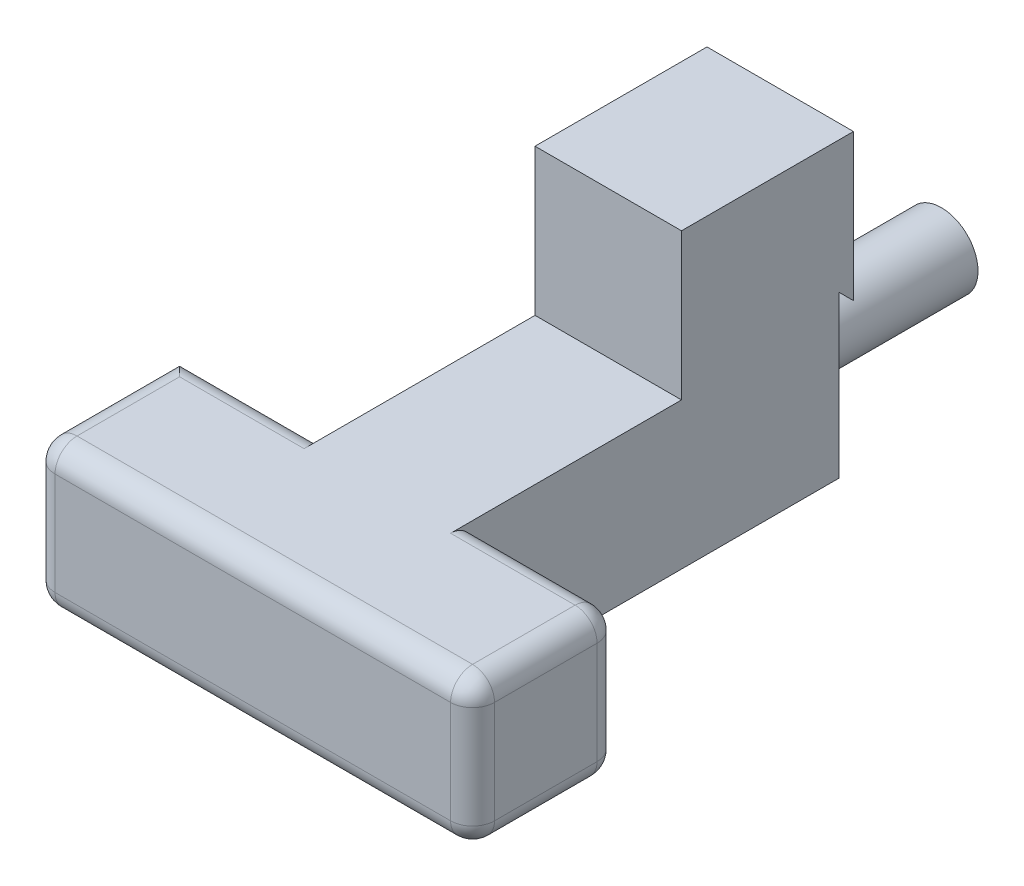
ISO-10303-21;
HEADER;
FILE_DESCRIPTION(('STEP AP214'),'2;1');
FILE_NAME('part.step','',(''),(''),'','','');
FILE_SCHEMA(('AUTOMOTIVE_DESIGN { 1 0 10303 214 1 1 1 1 }'));
ENDSEC;
DATA;
#1=APPLICATION_CONTEXT('core data for automotive mechanical design processes');
#2=APPLICATION_PROTOCOL_DEFINITION('international standard','automotive_design',2000,#1);
#3=PRODUCT_CONTEXT('',#1,'mechanical');
#4=PRODUCT('Part','Part','',(#3));
#5=PRODUCT_RELATED_PRODUCT_CATEGORY('part','',(#4));
#6=PRODUCT_DEFINITION_FORMATION('','',#4);
#7=PRODUCT_DEFINITION_CONTEXT('part definition',#1,'design');
#8=PRODUCT_DEFINITION('design','',#6,#7);
#9=PRODUCT_DEFINITION_SHAPE('','',#8);
#10=(LENGTH_UNIT() NAMED_UNIT(*) SI_UNIT(.MILLI.,.METRE.));
#11=(NAMED_UNIT(*) PLANE_ANGLE_UNIT() SI_UNIT($,.RADIAN.));
#12=(NAMED_UNIT(*) SI_UNIT($,.STERADIAN.) SOLID_ANGLE_UNIT());
#13=UNCERTAINTY_MEASURE_WITH_UNIT(LENGTH_MEASURE(1.E-05),#10,'distance_accuracy_value','');
#14=(GEOMETRIC_REPRESENTATION_CONTEXT(3) GLOBAL_UNCERTAINTY_ASSIGNED_CONTEXT((#13)) GLOBAL_UNIT_ASSIGNED_CONTEXT((#10,
#11,#12)) REPRESENTATION_CONTEXT('',''));
#15=CARTESIAN_POINT('',(0.,0.,0.));
#16=DIRECTION('',(0.,0.,1.));
#17=DIRECTION('',(1.,0.,0.));
#18=AXIS2_PLACEMENT_3D('',#15,#16,#17);
#19=CARTESIAN_POINT('',(10.,10.,25.));
#20=DIRECTION('',(-1.,0.,0.));
#21=DIRECTION('',(0.,0.,1.));
#22=AXIS2_PLACEMENT_3D('',#19,#20,#21);
#23=PLANE('',#22);
#24=DIRECTION('',(0.,0.707106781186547,0.707106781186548));
#25=VECTOR('',#24,1.);
#26=CARTESIAN_POINT('',(10.,12.,-25.));
#27=LINE('',#26,#25);
#28=CARTESIAN_POINT('',(10.,10.,-27.));
#29=VERTEX_POINT('',#28);
#30=CARTESIAN_POINT('',(10.,12.,-25.));
#31=VERTEX_POINT('',#30);
#32=EDGE_CURVE('E198',#29,#31,#27,.T.);
#33=ORIENTED_EDGE('',*,*,#32,.F.);
#34=DIRECTION('',(0.,-1.,0.));
#35=VECTOR('',#34,1.);
#36=CARTESIAN_POINT('',(10.,30.,-27.));
#37=LINE('',#36,#35);
#38=CARTESIAN_POINT('',(10.,30.,-27.));
#39=VERTEX_POINT('',#38);
#40=EDGE_CURVE('E231',#39,#29,#37,.T.);
#41=ORIENTED_EDGE('',*,*,#40,.F.);
#42=DIRECTION('',(0.,0.,-1.));
#43=VECTOR('',#42,1.);
#44=CARTESIAN_POINT('',(10.,30.,-3.52397749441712));
#45=LINE('',#44,#43);
#46=CARTESIAN_POINT('',(10.,30.,-3.52397749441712));
#47=VERTEX_POINT('',#46);
#48=EDGE_CURVE('E212',#47,#39,#45,.T.);
#49=ORIENTED_EDGE('',*,*,#48,.F.);
#50=DIRECTION('',(0.,-1.,0.));
#51=VECTOR('',#50,1.);
#52=CARTESIAN_POINT('',(10.,30.,-3.52397749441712));
#53=LINE('',#52,#51);
#54=CARTESIAN_POINT('',(10.,10.,-3.52397749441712));
#55=VERTEX_POINT('',#54);
#56=EDGE_CURVE('E222',#47,#55,#53,.T.);
#57=ORIENTED_EDGE('',*,*,#56,.T.);
#58=DIRECTION('',(0.,0.,-1.));
#59=VECTOR('',#58,1.);
#60=CARTESIAN_POINT('',(10.,10.,25.));
#61=LINE('',#60,#59);
#62=CARTESIAN_POINT('',(10.,10.,28.));
#63=VERTEX_POINT('',#62);
#64=EDGE_CURVE('E195',#63,#55,#61,.T.);
#65=ORIENTED_EDGE('',*,*,#64,.F.);
#66=CARTESIAN_POINT('',(10.,7.,28.));
#67=DIRECTION('',(-1.,0.,0.));
#68=DIRECTION('',(0.,0.,1.));
#69=AXIS2_PLACEMENT_3D('',#66,#67,#68);
#70=CIRCLE('',#69,3.);
#71=CARTESIAN_POINT('',(10.,7.,25.));
#72=VERTEX_POINT('',#71);
#73=EDGE_CURVE('E313',#63,#72,#70,.T.);
#74=ORIENTED_EDGE('',*,*,#73,.T.);
#75=DIRECTION('',(0.,-1.,0.));
#76=VECTOR('',#75,1.);
#77=CARTESIAN_POINT('',(10.,10.,25.));
#78=LINE('',#77,#76);
#79=CARTESIAN_POINT('',(10.,-7.,25.));
#80=VERTEX_POINT('',#79);
#81=EDGE_CURVE('E247',#72,#80,#78,.T.);
#82=ORIENTED_EDGE('',*,*,#81,.T.);
#83=CARTESIAN_POINT('',(10.,-7.,28.));
#84=DIRECTION('',(-1.,0.,0.));
#85=DIRECTION('',(0.,0.,1.));
#86=AXIS2_PLACEMENT_3D('',#83,#84,#85);
#87=CIRCLE('',#86,3.);
#88=CARTESIAN_POINT('',(10.,-10.,28.));
#89=VERTEX_POINT('',#88);
#90=EDGE_CURVE('E311',#80,#89,#87,.T.);
#91=ORIENTED_EDGE('',*,*,#90,.T.);
#92=DIRECTION('',(0.,0.,-1.));
#93=VECTOR('',#92,1.);
#94=CARTESIAN_POINT('',(10.,-10.,25.));
#95=LINE('',#94,#93);
#96=CARTESIAN_POINT('',(10.,-10.,-25.));
#97=VERTEX_POINT('',#96);
#98=EDGE_CURVE('E242',#89,#97,#95,.T.);
#99=ORIENTED_EDGE('',*,*,#98,.T.);
#100=DIRECTION('',(0.,-1.,0.));
#101=VECTOR('',#100,1.);
#102=CARTESIAN_POINT('',(10.,10.,-25.));
#103=LINE('',#102,#101);
#104=EDGE_CURVE('E53',#31,#97,#103,.T.);
#105=ORIENTED_EDGE('',*,*,#104,.F.);
#106=EDGE_LOOP('',(#33,#41,#49,#57,#65,#74,#82,#91,#99,#105));
#107=FACE_BOUND('',#106,.T.);
#108=ADVANCED_FACE('F39',(#107),#23,.F.);
#109=CARTESIAN_POINT('',(-10.,10.,25.));
#110=DIRECTION('',(1.,0.,0.));
#111=DIRECTION('',(0.,0.,-1.));
#112=AXIS2_PLACEMENT_3D('',#109,#110,#111);
#113=PLANE('',#112);
#114=DIRECTION('',(0.,-1.,0.));
#115=VECTOR('',#114,1.);
#116=CARTESIAN_POINT('',(-10.,30.,-27.));
#117=LINE('',#116,#115);
#118=CARTESIAN_POINT('',(-10.,30.,-27.));
#119=VERTEX_POINT('',#118);
#120=CARTESIAN_POINT('',(-10.,10.,-27.));
#121=VERTEX_POINT('',#120);
#122=EDGE_CURVE('E203',#119,#121,#117,.T.);
#123=ORIENTED_EDGE('',*,*,#122,.T.);
#124=DIRECTION('',(0.,0.707106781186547,0.707106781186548));
#125=VECTOR('',#124,1.);
#126=CARTESIAN_POINT('',(-10.,12.,-25.));
#127=LINE('',#126,#125);
#128=CARTESIAN_POINT('',(-10.,12.,-25.));
#129=VERTEX_POINT('',#128);
#130=EDGE_CURVE('E196',#121,#129,#127,.T.);
#131=ORIENTED_EDGE('',*,*,#130,.T.);
#132=DIRECTION('',(0.,-1.,0.));
#133=VECTOR('',#132,1.);
#134=CARTESIAN_POINT('',(-10.,10.,-25.));
#135=LINE('',#134,#133);
#136=CARTESIAN_POINT('',(-10.,-10.,-25.));
#137=VERTEX_POINT('',#136);
#138=EDGE_CURVE('E183',#129,#137,#135,.T.);
#139=ORIENTED_EDGE('',*,*,#138,.T.);
#140=DIRECTION('',(0.,0.,1.));
#141=VECTOR('',#140,1.);
#142=CARTESIAN_POINT('',(-10.,-10.,25.));
#143=LINE('',#142,#141);
#144=CARTESIAN_POINT('',(-10.,-10.,28.));
#145=VERTEX_POINT('',#144);
#146=EDGE_CURVE('E237',#137,#145,#143,.T.);
#147=ORIENTED_EDGE('',*,*,#146,.T.);
#148=CARTESIAN_POINT('',(-10.,-7.,28.));
#149=DIRECTION('',(1.,0.,0.));
#150=DIRECTION('',(0.,0.,-1.));
#151=AXIS2_PLACEMENT_3D('',#148,#149,#150);
#152=CIRCLE('',#151,3.);
#153=CARTESIAN_POINT('',(-10.,-7.,25.));
#154=VERTEX_POINT('',#153);
#155=EDGE_CURVE('E65',#145,#154,#152,.T.);
#156=ORIENTED_EDGE('',*,*,#155,.T.);
#157=DIRECTION('',(0.,-1.,0.));
#158=VECTOR('',#157,1.);
#159=CARTESIAN_POINT('',(-10.,10.,25.));
#160=LINE('',#159,#158);
#161=CARTESIAN_POINT('',(-10.,7.,25.));
#162=VERTEX_POINT('',#161);
#163=EDGE_CURVE('E252',#162,#154,#160,.T.);
#164=ORIENTED_EDGE('',*,*,#163,.F.);
#165=CARTESIAN_POINT('',(-10.,7.,28.));
#166=DIRECTION('',(1.,0.,0.));
#167=DIRECTION('',(0.,0.,-1.));
#168=AXIS2_PLACEMENT_3D('',#165,#166,#167);
#169=CIRCLE('',#168,3.);
#170=CARTESIAN_POINT('',(-10.,10.,28.));
#171=VERTEX_POINT('',#170);
#172=EDGE_CURVE('E50',#162,#171,#169,.T.);
#173=ORIENTED_EDGE('',*,*,#172,.T.);
#174=DIRECTION('',(0.,0.,1.));
#175=VECTOR('',#174,1.);
#176=CARTESIAN_POINT('',(-10.,10.,25.));
#177=LINE('',#176,#175);
#178=CARTESIAN_POINT('',(-10.,10.,-3.52397749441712));
#179=VERTEX_POINT('',#178);
#180=EDGE_CURVE('E239',#179,#171,#177,.T.);
#181=ORIENTED_EDGE('',*,*,#180,.F.);
#182=DIRECTION('',(0.,-1.,0.));
#183=VECTOR('',#182,1.);
#184=CARTESIAN_POINT('',(-10.,30.,-3.52397749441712));
#185=LINE('',#184,#183);
#186=CARTESIAN_POINT('',(-10.,30.,-3.52397749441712));
#187=VERTEX_POINT('',#186);
#188=EDGE_CURVE('E230',#187,#179,#185,.T.);
#189=ORIENTED_EDGE('',*,*,#188,.F.);
#190=DIRECTION('',(0.,0.,1.));
#191=VECTOR('',#190,1.);
#192=CARTESIAN_POINT('',(-10.,30.,-3.52397749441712));
#193=LINE('',#192,#191);
#194=EDGE_CURVE('E220',#119,#187,#193,.T.);
#195=ORIENTED_EDGE('',*,*,#194,.F.);
#196=EDGE_LOOP('',(#123,#131,#139,#147,#156,#164,#173,#181,#189,#195));
#197=FACE_BOUND('',#196,.T.);
#198=ADVANCED_FACE('F204',(#197),#113,.F.);
#199=CARTESIAN_POINT('',(10.,10.,-25.));
#200=DIRECTION('',(0.,0.,1.));
#201=DIRECTION('',(1.,0.,0.));
#202=AXIS2_PLACEMENT_3D('',#199,#200,#201);
#203=PLANE('',#202);
#204=CARTESIAN_POINT('',(0.,0.,-25.));
#205=DIRECTION('',(0.,0.,1.));
#206=DIRECTION('',(1.,0.,0.));
#207=AXIS2_PLACEMENT_3D('',#204,#205,#206);
#208=CIRCLE('',#207,5.);
#209=CARTESIAN_POINT('',(5.,0.,-25.));
#210=VERTEX_POINT('',#209);
#211=EDGE_CURVE('E11',#210,#210,#208,.F.);
#212=ORIENTED_EDGE('',*,*,#211,.F.);
#213=EDGE_LOOP('',(#212));
#214=FACE_BOUND('',#213,.T.);
#215=DIRECTION('',(-1.,0.,0.));
#216=VECTOR('',#215,1.);
#217=CARTESIAN_POINT('',(10.,-10.,-25.));
#218=LINE('',#217,#216);
#219=EDGE_CURVE('E186',#97,#137,#218,.T.);
#220=ORIENTED_EDGE('',*,*,#219,.T.);
#221=ORIENTED_EDGE('',*,*,#138,.F.);
#222=DIRECTION('',(1.,0.,0.));
#223=VECTOR('',#222,1.);
#224=CARTESIAN_POINT('',(-10.,12.,-25.));
#225=LINE('',#224,#223);
#226=EDGE_CURVE('E190',#129,#31,#225,.T.);
#227=ORIENTED_EDGE('',*,*,#226,.T.);
#228=ORIENTED_EDGE('',*,*,#104,.T.);
#229=EDGE_LOOP('',(#220,#221,#227,#228));
#230=FACE_BOUND('',#229,.T.);
#231=ADVANCED_FACE('F187',(#214,#230),#203,.F.);
#232=CARTESIAN_POINT('',(0.,10.,0.));
#233=DIRECTION('',(0.,1.,0.));
#234=DIRECTION('',(0.,0.,1.));
#235=AXIS2_PLACEMENT_3D('',#232,#233,#234);
#236=PLANE('',#235);
#237=DIRECTION('',(-1.,0.,0.));
#238=VECTOR('',#237,1.);
#239=CARTESIAN_POINT('',(10.,10.,28.));
#240=LINE('',#239,#238);
#241=CARTESIAN_POINT('',(27.,10.,28.));
#242=VERTEX_POINT('',#241);
#243=EDGE_CURVE('E265',#242,#63,#240,.T.);
#244=ORIENTED_EDGE('',*,*,#243,.T.);
#245=ORIENTED_EDGE('',*,*,#64,.T.);
#246=DIRECTION('',(1.,0.,0.));
#247=VECTOR('',#246,1.);
#248=CARTESIAN_POINT('',(-10.,10.,-3.52397749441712));
#249=LINE('',#248,#247);
#250=EDGE_CURVE('E213',#179,#55,#249,.T.);
#251=ORIENTED_EDGE('',*,*,#250,.F.);
#252=ORIENTED_EDGE('',*,*,#180,.T.);
#253=DIRECTION('',(-1.,0.,0.));
#254=VECTOR('',#253,1.);
#255=CARTESIAN_POINT('',(-30.,10.,28.));
#256=LINE('',#255,#254);
#257=CARTESIAN_POINT('',(-27.,10.,28.));
#258=VERTEX_POINT('',#257);
#259=EDGE_CURVE('E254',#171,#258,#256,.T.);
#260=ORIENTED_EDGE('',*,*,#259,.T.);
#261=DIRECTION('',(0.,0.,1.));
#262=VECTOR('',#261,1.);
#263=CARTESIAN_POINT('',(-27.,10.,45.));
#264=LINE('',#263,#262);
#265=CARTESIAN_POINT('',(-27.,10.,42.));
#266=VERTEX_POINT('',#265);
#267=EDGE_CURVE('E253',#258,#266,#264,.T.);
#268=ORIENTED_EDGE('',*,*,#267,.T.);
#269=DIRECTION('',(1.,0.,0.));
#270=VECTOR('',#269,1.);
#271=CARTESIAN_POINT('',(30.,10.,42.));
#272=LINE('',#271,#270);
#273=CARTESIAN_POINT('',(27.,10.,42.));
#274=VERTEX_POINT('',#273);
#275=EDGE_CURVE('E259',#266,#274,#272,.T.);
#276=ORIENTED_EDGE('',*,*,#275,.T.);
#277=DIRECTION('',(0.,0.,-1.));
#278=VECTOR('',#277,1.);
#279=CARTESIAN_POINT('',(27.,10.,25.));
#280=LINE('',#279,#278);
#281=EDGE_CURVE('E258',#274,#242,#280,.T.);
#282=ORIENTED_EDGE('',*,*,#281,.T.);
#283=EDGE_LOOP('',(#244,#245,#251,#252,#260,#268,#276,#282));
#284=FACE_BOUND('',#283,.T.);
#285=ADVANCED_FACE('F534',(#284),#236,.T.);
#286=CARTESIAN_POINT('',(0.,-10.,0.));
#287=DIRECTION('',(0.,1.,0.));
#288=DIRECTION('',(0.,0.,1.));
#289=AXIS2_PLACEMENT_3D('',#286,#287,#288);
#290=PLANE('',#289);
#291=DIRECTION('',(-1.,0.,0.));
#292=VECTOR('',#291,1.);
#293=CARTESIAN_POINT('',(0.,-10.,28.));
#294=LINE('',#293,#292);
#295=CARTESIAN_POINT('',(-27.,-10.,28.));
#296=VERTEX_POINT('',#295);
#297=EDGE_CURVE('E303',#296,#145,#294,.F.);
#298=ORIENTED_EDGE('',*,*,#297,.T.);
#299=ORIENTED_EDGE('',*,*,#146,.F.);
#300=ORIENTED_EDGE('',*,*,#219,.F.);
#301=ORIENTED_EDGE('',*,*,#98,.F.);
#302=DIRECTION('',(-1.,0.,0.));
#303=VECTOR('',#302,1.);
#304=CARTESIAN_POINT('',(0.,-10.,28.));
#305=LINE('',#304,#303);
#306=CARTESIAN_POINT('',(27.,-10.,28.));
#307=VERTEX_POINT('',#306);
#308=EDGE_CURVE('E300',#89,#307,#305,.F.);
#309=ORIENTED_EDGE('',*,*,#308,.T.);
#310=DIRECTION('',(0.,0.,-1.));
#311=VECTOR('',#310,1.);
#312=CARTESIAN_POINT('',(27.,-10.,0.));
#313=LINE('',#312,#311);
#314=CARTESIAN_POINT('',(27.,-10.,42.));
#315=VERTEX_POINT('',#314);
#316=EDGE_CURVE('E294',#307,#315,#313,.F.);
#317=ORIENTED_EDGE('',*,*,#316,.T.);
#318=DIRECTION('',(1.,0.,0.));
#319=VECTOR('',#318,1.);
#320=CARTESIAN_POINT('',(0.,-10.,42.));
#321=LINE('',#320,#319);
#322=CARTESIAN_POINT('',(-27.,-10.,42.));
#323=VERTEX_POINT('',#322);
#324=EDGE_CURVE('E299',#315,#323,#321,.F.);
#325=ORIENTED_EDGE('',*,*,#324,.T.);
#326=DIRECTION('',(0.,0.,1.));
#327=VECTOR('',#326,1.);
#328=CARTESIAN_POINT('',(-27.,-10.,0.));
#329=LINE('',#328,#327);
#330=EDGE_CURVE('E301',#323,#296,#329,.F.);
#331=ORIENTED_EDGE('',*,*,#330,.T.);
#332=EDGE_LOOP('',(#298,#299,#300,#301,#309,#317,#325,#331));
#333=FACE_BOUND('',#332,.T.);
#334=ADVANCED_FACE('F399',(#333),#290,.F.);
#335=CARTESIAN_POINT('',(30.,10.,25.));
#336=DIRECTION('',(0.,0.,1.));
#337=DIRECTION('',(1.,0.,0.));
#338=AXIS2_PLACEMENT_3D('',#335,#336,#337);
#339=PLANE('',#338);
#340=ORIENTED_EDGE('',*,*,#163,.T.);
#341=DIRECTION('',(-1.,0.,0.));
#342=VECTOR('',#341,1.);
#343=CARTESIAN_POINT('',(30.,-7.,25.));
#344=LINE('',#343,#342);
#345=CARTESIAN_POINT('',(-30.,-7.,25.));
#346=VERTEX_POINT('',#345);
#347=EDGE_CURVE('E308',#154,#346,#344,.T.);
#348=ORIENTED_EDGE('',*,*,#347,.T.);
#349=DIRECTION('',(0.,-1.,0.));
#350=VECTOR('',#349,1.);
#351=CARTESIAN_POINT('',(-30.,10.,25.));
#352=LINE('',#351,#350);
#353=CARTESIAN_POINT('',(-30.,7.,25.));
#354=VERTEX_POINT('',#353);
#355=EDGE_CURVE('E236',#354,#346,#352,.T.);
#356=ORIENTED_EDGE('',*,*,#355,.F.);
#357=DIRECTION('',(-1.,0.,0.));
#358=VECTOR('',#357,1.);
#359=CARTESIAN_POINT('',(-10.,7.,25.));
#360=LINE('',#359,#358);
#361=EDGE_CURVE('E306',#354,#162,#360,.F.);
#362=ORIENTED_EDGE('',*,*,#361,.T.);
#363=EDGE_LOOP('',(#340,#348,#356,#362));
#364=FACE_BOUND('',#363,.T.);
#365=ADVANCED_FACE('F456',(#364),#339,.F.);
#366=CARTESIAN_POINT('',(-30.,10.,45.));
#367=DIRECTION('',(1.,0.,0.));
#368=DIRECTION('',(0.,0.,-1.));
#369=AXIS2_PLACEMENT_3D('',#366,#367,#368);
#370=PLANE('',#369);
#371=DIRECTION('',(0.,-1.,0.));
#372=VECTOR('',#371,1.);
#373=CARTESIAN_POINT('',(-30.,10.,42.));
#374=LINE('',#373,#372);
#375=CARTESIAN_POINT('',(-30.,-7.,42.));
#376=VERTEX_POINT('',#375);
#377=CARTESIAN_POINT('',(-30.,7.,42.));
#378=VERTEX_POINT('',#377);
#379=EDGE_CURVE('E264',#376,#378,#374,.F.);
#380=ORIENTED_EDGE('',*,*,#379,.T.);
#381=DIRECTION('',(0.,0.,1.));
#382=VECTOR('',#381,1.);
#383=CARTESIAN_POINT('',(-30.,7.,25.));
#384=LINE('',#383,#382);
#385=EDGE_CURVE('E266',#378,#354,#384,.F.);
#386=ORIENTED_EDGE('',*,*,#385,.T.);
#387=ORIENTED_EDGE('',*,*,#355,.T.);
#388=DIRECTION('',(0.,0.,1.));
#389=VECTOR('',#388,1.);
#390=CARTESIAN_POINT('',(-30.,-7.,45.));
#391=LINE('',#390,#389);
#392=EDGE_CURVE('E269',#346,#376,#391,.T.);
#393=ORIENTED_EDGE('',*,*,#392,.T.);
#394=EDGE_LOOP('',(#380,#386,#387,#393));
#395=FACE_BOUND('',#394,.T.);
#396=ADVANCED_FACE('F455',(#395),#370,.F.);
#397=CARTESIAN_POINT('',(30.,10.,45.));
#398=DIRECTION('',(0.,0.,-1.));
#399=DIRECTION('',(-1.,0.,0.));
#400=AXIS2_PLACEMENT_3D('',#397,#398,#399);
#401=PLANE('',#400);
#402=DIRECTION('',(0.,-1.,0.));
#403=VECTOR('',#402,1.);
#404=CARTESIAN_POINT('',(-27.,10.,45.));
#405=LINE('',#404,#403);
#406=CARTESIAN_POINT('',(-27.,7.,45.));
#407=VERTEX_POINT('',#406);
#408=CARTESIAN_POINT('',(-27.,-7.,45.));
#409=VERTEX_POINT('',#408);
#410=EDGE_CURVE('E290',#407,#409,#405,.T.);
#411=ORIENTED_EDGE('',*,*,#410,.T.);
#412=DIRECTION('',(1.,0.,0.));
#413=VECTOR('',#412,1.);
#414=CARTESIAN_POINT('',(30.,-7.,45.));
#415=LINE('',#414,#413);
#416=CARTESIAN_POINT('',(27.,-7.,45.));
#417=VERTEX_POINT('',#416);
#418=EDGE_CURVE('E292',#409,#417,#415,.T.);
#419=ORIENTED_EDGE('',*,*,#418,.T.);
#420=DIRECTION('',(0.,-1.,0.));
#421=VECTOR('',#420,1.);
#422=CARTESIAN_POINT('',(27.,10.,45.));
#423=LINE('',#422,#421);
#424=CARTESIAN_POINT('',(27.,7.,45.));
#425=VERTEX_POINT('',#424);
#426=EDGE_CURVE('E288',#417,#425,#423,.F.);
#427=ORIENTED_EDGE('',*,*,#426,.T.);
#428=DIRECTION('',(1.,0.,0.));
#429=VECTOR('',#428,1.);
#430=CARTESIAN_POINT('',(-30.,7.,45.));
#431=LINE('',#430,#429);
#432=EDGE_CURVE('E287',#425,#407,#431,.F.);
#433=ORIENTED_EDGE('',*,*,#432,.T.);
#434=EDGE_LOOP('',(#411,#419,#427,#433));
#435=FACE_BOUND('',#434,.T.);
#436=ADVANCED_FACE('F431',(#435),#401,.F.);
#437=CARTESIAN_POINT('',(30.,10.,45.));
#438=DIRECTION('',(-1.,0.,0.));
#439=DIRECTION('',(0.,0.,1.));
#440=AXIS2_PLACEMENT_3D('',#437,#438,#439);
#441=PLANE('',#440);
#442=DIRECTION('',(0.,-1.,0.));
#443=VECTOR('',#442,1.);
#444=CARTESIAN_POINT('',(30.,10.,42.));
#445=LINE('',#444,#443);
#446=CARTESIAN_POINT('',(30.,7.,42.));
#447=VERTEX_POINT('',#446);
#448=CARTESIAN_POINT('',(30.,-7.,42.));
#449=VERTEX_POINT('',#448);
#450=EDGE_CURVE('E276',#447,#449,#445,.T.);
#451=ORIENTED_EDGE('',*,*,#450,.T.);
#452=DIRECTION('',(0.,0.,-1.));
#453=VECTOR('',#452,1.);
#454=CARTESIAN_POINT('',(30.,-7.,45.));
#455=LINE('',#454,#453);
#456=CARTESIAN_POINT('',(30.,-7.,28.));
#457=VERTEX_POINT('',#456);
#458=EDGE_CURVE('E282',#449,#457,#455,.T.);
#459=ORIENTED_EDGE('',*,*,#458,.T.);
#460=DIRECTION('',(0.,-1.,0.));
#461=VECTOR('',#460,1.);
#462=CARTESIAN_POINT('',(30.,10.,28.));
#463=LINE('',#462,#461);
#464=CARTESIAN_POINT('',(30.,7.,28.));
#465=VERTEX_POINT('',#464);
#466=EDGE_CURVE('E281',#457,#465,#463,.F.);
#467=ORIENTED_EDGE('',*,*,#466,.T.);
#468=DIRECTION('',(0.,0.,-1.));
#469=VECTOR('',#468,1.);
#470=CARTESIAN_POINT('',(30.,7.,45.));
#471=LINE('',#470,#469);
#472=EDGE_CURVE('E280',#465,#447,#471,.F.);
#473=ORIENTED_EDGE('',*,*,#472,.T.);
#474=EDGE_LOOP('',(#451,#459,#467,#473));
#475=FACE_BOUND('',#474,.T.);
#476=ADVANCED_FACE('F386',(#475),#441,.F.);
#477=DIRECTION('',(0.,-1.,0.));
#478=VECTOR('',#477,1.);
#479=CARTESIAN_POINT('',(27.,10.,25.));
#480=LINE('',#479,#478);
#481=CARTESIAN_POINT('',(27.,7.,25.));
#482=VERTEX_POINT('',#481);
#483=CARTESIAN_POINT('',(27.,-7.,25.));
#484=VERTEX_POINT('',#483);
#485=EDGE_CURVE('E271',#482,#484,#480,.T.);
#486=ORIENTED_EDGE('',*,*,#485,.T.);
#487=DIRECTION('',(-1.,0.,0.));
#488=VECTOR('',#487,1.);
#489=CARTESIAN_POINT('',(30.,-7.,25.));
#490=LINE('',#489,#488);
#491=EDGE_CURVE('E273',#484,#80,#490,.T.);
#492=ORIENTED_EDGE('',*,*,#491,.T.);
#493=ORIENTED_EDGE('',*,*,#81,.F.);
#494=DIRECTION('',(-1.,0.,0.));
#495=VECTOR('',#494,1.);
#496=CARTESIAN_POINT('',(30.,7.,25.));
#497=LINE('',#496,#495);
#498=EDGE_CURVE('E272',#72,#482,#497,.F.);
#499=ORIENTED_EDGE('',*,*,#498,.T.);
#500=EDGE_LOOP('',(#486,#492,#493,#499));
#501=FACE_BOUND('',#500,.T.);
#502=ADVANCED_FACE('F403',(#501),#339,.F.);
#503=CARTESIAN_POINT('',(-10.,30.,-27.));
#504=DIRECTION('',(0.,0.,1.));
#505=DIRECTION('',(1.,0.,0.));
#506=AXIS2_PLACEMENT_3D('',#503,#504,#505);
#507=PLANE('',#506);
#508=DIRECTION('',(-1.,0.,0.));
#509=VECTOR('',#508,1.);
#510=CARTESIAN_POINT('',(-10.,10.,-27.));
#511=LINE('',#510,#509);
#512=EDGE_CURVE('E224',#29,#121,#511,.T.);
#513=ORIENTED_EDGE('',*,*,#512,.T.);
#514=ORIENTED_EDGE('',*,*,#122,.F.);
#515=DIRECTION('',(-1.,0.,0.));
#516=VECTOR('',#515,1.);
#517=CARTESIAN_POINT('',(-10.,30.,-27.));
#518=LINE('',#517,#516);
#519=EDGE_CURVE('E211',#39,#119,#518,.T.);
#520=ORIENTED_EDGE('',*,*,#519,.F.);
#521=ORIENTED_EDGE('',*,*,#40,.T.);
#522=EDGE_LOOP('',(#513,#514,#520,#521));
#523=FACE_BOUND('',#522,.T.);
#524=ADVANCED_FACE('F579',(#523),#507,.F.);
#525=CARTESIAN_POINT('',(-10.,30.,-3.52397749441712));
#526=DIRECTION('',(0.,0.,-1.));
#527=DIRECTION('',(-1.,0.,0.));
#528=AXIS2_PLACEMENT_3D('',#525,#526,#527);
#529=PLANE('',#528);
#530=ORIENTED_EDGE('',*,*,#250,.T.);
#531=ORIENTED_EDGE('',*,*,#56,.F.);
#532=DIRECTION('',(1.,0.,0.));
#533=VECTOR('',#532,1.);
#534=CARTESIAN_POINT('',(-10.,30.,-3.52397749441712));
#535=LINE('',#534,#533);
#536=EDGE_CURVE('E217',#187,#47,#535,.T.);
#537=ORIENTED_EDGE('',*,*,#536,.F.);
#538=ORIENTED_EDGE('',*,*,#188,.T.);
#539=EDGE_LOOP('',(#530,#531,#537,#538));
#540=FACE_BOUND('',#539,.T.);
#541=ADVANCED_FACE('F573',(#540),#529,.F.);
#542=CARTESIAN_POINT('',(0.,30.,0.));
#543=DIRECTION('',(0.,-1.,0.));
#544=DIRECTION('',(0.,0.,-1.));
#545=AXIS2_PLACEMENT_3D('',#542,#543,#544);
#546=PLANE('',#545);
#547=ORIENTED_EDGE('',*,*,#48,.T.);
#548=ORIENTED_EDGE('',*,*,#519,.T.);
#549=ORIENTED_EDGE('',*,*,#194,.T.);
#550=ORIENTED_EDGE('',*,*,#536,.T.);
#551=EDGE_LOOP('',(#547,#548,#549,#550));
#552=FACE_BOUND('',#551,.T.);
#553=ADVANCED_FACE('F571',(#552),#546,.F.);
#554=CARTESIAN_POINT('',(30.,-7.,28.));
#555=DIRECTION('',(-1.,0.,0.));
#556=DIRECTION('',(0.,0.,1.));
#557=AXIS2_PLACEMENT_3D('',#554,#555,#556);
#558=CYLINDRICAL_SURFACE('',#557,3.);
#559=CARTESIAN_POINT('',(27.,-7.,28.));
#560=DIRECTION('',(1.,0.,0.));
#561=DIRECTION('',(0.,0.,-1.));
#562=AXIS2_PLACEMENT_3D('',#559,#560,#561);
#563=CIRCLE('',#562,3.);
#564=EDGE_CURVE('E221',#307,#484,#563,.T.);
#565=ORIENTED_EDGE('',*,*,#564,.F.);
#566=ORIENTED_EDGE('',*,*,#308,.F.);
#567=ORIENTED_EDGE('',*,*,#90,.F.);
#568=ORIENTED_EDGE('',*,*,#491,.F.);
#569=EDGE_LOOP('',(#565,#566,#567,#568));
#570=FACE_BOUND('',#569,.T.);
#571=ADVANCED_FACE('F41',(#570),#558,.T.);
#572=CARTESIAN_POINT('',(27.,-7.,28.));
#573=DIRECTION('',(0.,0.,-1.));
#574=DIRECTION('',(0.,1.,0.));
#575=AXIS2_PLACEMENT_3D('',#572,#573,#574);
#576=SPHERICAL_SURFACE('',#575,3.);
#577=CARTESIAN_POINT('',(27.,-7.,28.));
#578=DIRECTION('',(0.,0.,-1.));
#579=DIRECTION('',(-1.,0.,0.));
#580=AXIS2_PLACEMENT_3D('',#577,#578,#579);
#581=CIRCLE('',#580,3.);
#582=EDGE_CURVE('E370',#307,#457,#581,.F.);
#583=ORIENTED_EDGE('',*,*,#582,.F.);
#584=ORIENTED_EDGE('',*,*,#564,.T.);
#585=CARTESIAN_POINT('',(27.,-7.,28.));
#586=DIRECTION('',(0.,-1.,0.));
#587=DIRECTION('',(0.,0.,-1.));
#588=AXIS2_PLACEMENT_3D('',#585,#586,#587);
#589=CIRCLE('',#588,3.);
#590=EDGE_CURVE('E369',#457,#484,#589,.F.);
#591=ORIENTED_EDGE('',*,*,#590,.F.);
#592=EDGE_LOOP('',(#583,#584,#591));
#593=FACE_BOUND('',#592,.T.);
#594=ADVANCED_FACE('F380',(#593),#576,.T.);
#595=CARTESIAN_POINT('',(0.,7.,28.));
#596=DIRECTION('',(1.,0.,0.));
#597=DIRECTION('',(0.,0.,-1.));
#598=AXIS2_PLACEMENT_3D('',#595,#596,#597);
#599=CYLINDRICAL_SURFACE('',#598,3.);
#600=ORIENTED_EDGE('',*,*,#73,.F.);
#601=ORIENTED_EDGE('',*,*,#243,.F.);
#602=CARTESIAN_POINT('',(27.,7.,28.));
#603=DIRECTION('',(1.,0.,0.));
#604=DIRECTION('',(0.,0.,-1.));
#605=AXIS2_PLACEMENT_3D('',#602,#603,#604);
#606=CIRCLE('',#605,3.);
#607=EDGE_CURVE('E364',#482,#242,#606,.T.);
#608=ORIENTED_EDGE('',*,*,#607,.F.);
#609=ORIENTED_EDGE('',*,*,#498,.F.);
#610=EDGE_LOOP('',(#600,#601,#608,#609));
#611=FACE_BOUND('',#610,.T.);
#612=ADVANCED_FACE('F410',(#611),#599,.T.);
#613=CARTESIAN_POINT('',(27.,10.,28.));
#614=DIRECTION('',(0.,-1.,0.));
#615=DIRECTION('',(0.,0.,-1.));
#616=AXIS2_PLACEMENT_3D('',#613,#614,#615);
#617=CYLINDRICAL_SURFACE('',#616,3.);
#618=ORIENTED_EDGE('',*,*,#590,.T.);
#619=ORIENTED_EDGE('',*,*,#485,.F.);
#620=CARTESIAN_POINT('',(27.,7.,28.));
#621=DIRECTION('',(0.,1.,0.));
#622=DIRECTION('',(0.,0.,1.));
#623=AXIS2_PLACEMENT_3D('',#620,#621,#622);
#624=CIRCLE('',#623,3.);
#625=EDGE_CURVE('E363',#465,#482,#624,.T.);
#626=ORIENTED_EDGE('',*,*,#625,.F.);
#627=ORIENTED_EDGE('',*,*,#466,.F.);
#628=EDGE_LOOP('',(#618,#619,#626,#627));
#629=FACE_BOUND('',#628,.T.);
#630=ADVANCED_FACE('F383',(#629),#617,.T.);
#631=CARTESIAN_POINT('',(27.,-7.,45.));
#632=DIRECTION('',(0.,0.,-1.));
#633=DIRECTION('',(-1.,0.,0.));
#634=AXIS2_PLACEMENT_3D('',#631,#632,#633);
#635=CYLINDRICAL_SURFACE('',#634,3.);
#636=ORIENTED_EDGE('',*,*,#582,.T.);
#637=ORIENTED_EDGE('',*,*,#458,.F.);
#638=CARTESIAN_POINT('',(27.,-7.,42.));
#639=DIRECTION('',(0.,0.,1.));
#640=DIRECTION('',(1.,0.,0.));
#641=AXIS2_PLACEMENT_3D('',#638,#639,#640);
#642=CIRCLE('',#641,3.);
#643=EDGE_CURVE('E356',#315,#449,#642,.T.);
#644=ORIENTED_EDGE('',*,*,#643,.F.);
#645=ORIENTED_EDGE('',*,*,#316,.F.);
#646=EDGE_LOOP('',(#636,#637,#644,#645));
#647=FACE_BOUND('',#646,.T.);
#648=ADVANCED_FACE('F392',(#647),#635,.T.);
#649=CARTESIAN_POINT('',(27.,7.,28.));
#650=DIRECTION('',(0.,0.,-1.));
#651=DIRECTION('',(-1.,0.,0.));
#652=AXIS2_PLACEMENT_3D('',#649,#650,#651);
#653=SPHERICAL_SURFACE('',#652,3.);
#654=ORIENTED_EDGE('',*,*,#625,.T.);
#655=ORIENTED_EDGE('',*,*,#607,.T.);
#656=CARTESIAN_POINT('',(27.,7.,28.));
#657=DIRECTION('',(0.,0.,-1.));
#658=DIRECTION('',(-1.,0.,0.));
#659=AXIS2_PLACEMENT_3D('',#656,#657,#658);
#660=CIRCLE('',#659,3.);
#661=EDGE_CURVE('E353',#465,#242,#660,.F.);
#662=ORIENTED_EDGE('',*,*,#661,.F.);
#663=EDGE_LOOP('',(#654,#655,#662));
#664=FACE_BOUND('',#663,.T.);
#665=ADVANCED_FACE('F411',(#664),#653,.T.);
#666=CARTESIAN_POINT('',(27.,-7.,42.));
#667=DIRECTION('',(1.,0.,0.));
#668=DIRECTION('',(0.,1.,0.));
#669=AXIS2_PLACEMENT_3D('',#666,#667,#668);
#670=SPHERICAL_SURFACE('',#669,3.);
#671=CARTESIAN_POINT('',(27.,-7.,42.));
#672=DIRECTION('',(1.,0.,0.));
#673=DIRECTION('',(0.,0.,-1.));
#674=AXIS2_PLACEMENT_3D('',#671,#672,#673);
#675=CIRCLE('',#674,3.);
#676=EDGE_CURVE('E347',#315,#417,#675,.F.);
#677=ORIENTED_EDGE('',*,*,#676,.F.);
#678=ORIENTED_EDGE('',*,*,#643,.T.);
#679=CARTESIAN_POINT('',(27.,-7.,42.));
#680=DIRECTION('',(0.,-1.,0.));
#681=DIRECTION('',(0.,0.,-1.));
#682=AXIS2_PLACEMENT_3D('',#679,#680,#681);
#683=CIRCLE('',#682,3.);
#684=EDGE_CURVE('E354',#417,#449,#683,.F.);
#685=ORIENTED_EDGE('',*,*,#684,.F.);
#686=EDGE_LOOP('',(#677,#678,#685));
#687=FACE_BOUND('',#686,.T.);
#688=ADVANCED_FACE('F424',(#687),#670,.T.);
#689=CARTESIAN_POINT('',(30.,-7.,28.));
#690=DIRECTION('',(-1.,0.,0.));
#691=DIRECTION('',(0.,0.,1.));
#692=AXIS2_PLACEMENT_3D('',#689,#690,#691);
#693=CYLINDRICAL_SURFACE('',#692,3.);
#694=ORIENTED_EDGE('',*,*,#155,.F.);
#695=ORIENTED_EDGE('',*,*,#297,.F.);
#696=CARTESIAN_POINT('',(-27.,-7.,28.));
#697=DIRECTION('',(-0.707106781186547,0.,0.707106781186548));
#698=DIRECTION('',(-0.707106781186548,0.,-0.707106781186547));
#699=AXIS2_PLACEMENT_3D('',#696,#697,#698);
#700=ELLIPSE('',#699,4.24264068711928,3.);
#701=EDGE_CURVE('E346',#346,#296,#700,.T.);
#702=ORIENTED_EDGE('',*,*,#701,.F.);
#703=ORIENTED_EDGE('',*,*,#347,.F.);
#704=EDGE_LOOP('',(#694,#695,#702,#703));
#705=FACE_BOUND('',#704,.T.);
#706=ADVANCED_FACE('F463',(#705),#693,.T.);
#707=CARTESIAN_POINT('',(27.,7.,0.));
#708=DIRECTION('',(0.,0.,1.));
#709=DIRECTION('',(1.,0.,0.));
#710=AXIS2_PLACEMENT_3D('',#707,#708,#709);
#711=CYLINDRICAL_SURFACE('',#710,3.);
#712=ORIENTED_EDGE('',*,*,#661,.T.);
#713=ORIENTED_EDGE('',*,*,#281,.F.);
#714=CARTESIAN_POINT('',(27.,7.,42.));
#715=DIRECTION('',(0.,0.,1.));
#716=DIRECTION('',(1.,0.,0.));
#717=AXIS2_PLACEMENT_3D('',#714,#715,#716);
#718=CIRCLE('',#717,3.);
#719=EDGE_CURVE('E344',#447,#274,#718,.T.);
#720=ORIENTED_EDGE('',*,*,#719,.F.);
#721=ORIENTED_EDGE('',*,*,#472,.F.);
#722=EDGE_LOOP('',(#712,#713,#720,#721));
#723=FACE_BOUND('',#722,.T.);
#724=ADVANCED_FACE('F412',(#723),#711,.T.);
#725=CARTESIAN_POINT('',(27.,10.,42.));
#726=DIRECTION('',(0.,-1.,0.));
#727=DIRECTION('',(0.,0.,-1.));
#728=AXIS2_PLACEMENT_3D('',#725,#726,#727);
#729=CYLINDRICAL_SURFACE('',#728,3.);
#730=ORIENTED_EDGE('',*,*,#684,.T.);
#731=ORIENTED_EDGE('',*,*,#450,.F.);
#732=CARTESIAN_POINT('',(27.,7.,42.));
#733=DIRECTION('',(0.,1.,0.));
#734=DIRECTION('',(0.,0.,1.));
#735=AXIS2_PLACEMENT_3D('',#732,#733,#734);
#736=CIRCLE('',#735,3.);
#737=EDGE_CURVE('E338',#425,#447,#736,.T.);
#738=ORIENTED_EDGE('',*,*,#737,.F.);
#739=ORIENTED_EDGE('',*,*,#426,.F.);
#740=EDGE_LOOP('',(#730,#731,#738,#739));
#741=FACE_BOUND('',#740,.T.);
#742=ADVANCED_FACE('F422',(#741),#729,.T.);
#743=CARTESIAN_POINT('',(30.,-7.,42.));
#744=DIRECTION('',(1.,0.,0.));
#745=DIRECTION('',(0.,0.,-1.));
#746=AXIS2_PLACEMENT_3D('',#743,#744,#745);
#747=CYLINDRICAL_SURFACE('',#746,3.);
#748=ORIENTED_EDGE('',*,*,#676,.T.);
#749=ORIENTED_EDGE('',*,*,#418,.F.);
#750=CARTESIAN_POINT('',(-27.,-7.,42.));
#751=DIRECTION('',(-1.,0.,0.));
#752=DIRECTION('',(0.,0.,1.));
#753=AXIS2_PLACEMENT_3D('',#750,#751,#752);
#754=CIRCLE('',#753,3.);
#755=EDGE_CURVE('E340',#323,#409,#754,.T.);
#756=ORIENTED_EDGE('',*,*,#755,.F.);
#757=ORIENTED_EDGE('',*,*,#324,.F.);
#758=EDGE_LOOP('',(#748,#749,#756,#757));
#759=FACE_BOUND('',#758,.T.);
#760=ADVANCED_FACE('F426',(#759),#747,.T.);
#761=CARTESIAN_POINT('',(-27.,-7.,45.));
#762=DIRECTION('',(0.,0.,1.));
#763=DIRECTION('',(1.,0.,0.));
#764=AXIS2_PLACEMENT_3D('',#761,#762,#763);
#765=CYLINDRICAL_SURFACE('',#764,3.);
#766=ORIENTED_EDGE('',*,*,#701,.T.);
#767=ORIENTED_EDGE('',*,*,#330,.F.);
#768=CARTESIAN_POINT('',(-27.,-7.,42.));
#769=DIRECTION('',(0.,0.,1.));
#770=DIRECTION('',(1.,0.,0.));
#771=AXIS2_PLACEMENT_3D('',#768,#769,#770);
#772=CIRCLE('',#771,3.);
#773=EDGE_CURVE('E331',#376,#323,#772,.T.);
#774=ORIENTED_EDGE('',*,*,#773,.F.);
#775=ORIENTED_EDGE('',*,*,#392,.F.);
#776=EDGE_LOOP('',(#766,#767,#774,#775));
#777=FACE_BOUND('',#776,.T.);
#778=ADVANCED_FACE('F468',(#777),#765,.T.);
#779=CARTESIAN_POINT('',(27.,7.,42.));
#780=DIRECTION('',(1.,0.,0.));
#781=DIRECTION('',(0.,0.,-1.));
#782=AXIS2_PLACEMENT_3D('',#779,#780,#781);
#783=SPHERICAL_SURFACE('',#782,3.);
#784=ORIENTED_EDGE('',*,*,#737,.T.);
#785=ORIENTED_EDGE('',*,*,#719,.T.);
#786=CARTESIAN_POINT('',(27.,7.,42.));
#787=DIRECTION('',(1.,0.,0.));
#788=DIRECTION('',(0.,0.,-1.));
#789=AXIS2_PLACEMENT_3D('',#786,#787,#788);
#790=CIRCLE('',#789,3.);
#791=EDGE_CURVE('E332',#425,#274,#790,.F.);
#792=ORIENTED_EDGE('',*,*,#791,.F.);
#793=EDGE_LOOP('',(#784,#785,#792));
#794=FACE_BOUND('',#793,.T.);
#795=ADVANCED_FACE('F416',(#794),#783,.T.);
#796=CARTESIAN_POINT('',(-27.,-7.,42.));
#797=DIRECTION('',(0.,-1.,0.));
#798=DIRECTION('',(0.,0.,-1.));
#799=AXIS2_PLACEMENT_3D('',#796,#797,#798);
#800=SPHERICAL_SURFACE('',#799,3.);
#801=ORIENTED_EDGE('',*,*,#773,.T.);
#802=ORIENTED_EDGE('',*,*,#755,.T.);
#803=CARTESIAN_POINT('',(-27.,-7.,42.));
#804=DIRECTION('',(0.,-1.,0.));
#805=DIRECTION('',(0.,0.,-1.));
#806=AXIS2_PLACEMENT_3D('',#803,#804,#805);
#807=CIRCLE('',#806,3.);
#808=EDGE_CURVE('E328',#376,#409,#807,.F.);
#809=ORIENTED_EDGE('',*,*,#808,.F.);
#810=EDGE_LOOP('',(#801,#802,#809));
#811=FACE_BOUND('',#810,.T.);
#812=ADVANCED_FACE('F475',(#811),#800,.T.);
#813=CARTESIAN_POINT('',(0.,7.,42.));
#814=DIRECTION('',(-1.,0.,0.));
#815=DIRECTION('',(0.,0.,1.));
#816=AXIS2_PLACEMENT_3D('',#813,#814,#815);
#817=CYLINDRICAL_SURFACE('',#816,3.);
#818=ORIENTED_EDGE('',*,*,#791,.T.);
#819=ORIENTED_EDGE('',*,*,#275,.F.);
#820=CARTESIAN_POINT('',(-27.,7.,42.));
#821=DIRECTION('',(-1.,0.,0.));
#822=DIRECTION('',(0.,-1.,0.));
#823=AXIS2_PLACEMENT_3D('',#820,#821,#822);
#824=CIRCLE('',#823,3.);
#825=EDGE_CURVE('E323',#407,#266,#824,.T.);
#826=ORIENTED_EDGE('',*,*,#825,.F.);
#827=ORIENTED_EDGE('',*,*,#432,.F.);
#828=EDGE_LOOP('',(#818,#819,#826,#827));
#829=FACE_BOUND('',#828,.T.);
#830=ADVANCED_FACE('F445',(#829),#817,.T.);
#831=CARTESIAN_POINT('',(-27.,10.,42.));
#832=DIRECTION('',(0.,-1.,0.));
#833=DIRECTION('',(0.,0.,-1.));
#834=AXIS2_PLACEMENT_3D('',#831,#832,#833);
#835=CYLINDRICAL_SURFACE('',#834,3.);
#836=ORIENTED_EDGE('',*,*,#808,.T.);
#837=ORIENTED_EDGE('',*,*,#410,.F.);
#838=CARTESIAN_POINT('',(-27.,7.,42.));
#839=DIRECTION('',(0.,1.,0.));
#840=DIRECTION('',(0.,0.,1.));
#841=AXIS2_PLACEMENT_3D('',#838,#839,#840);
#842=CIRCLE('',#841,3.);
#843=EDGE_CURVE('E325',#378,#407,#842,.T.);
#844=ORIENTED_EDGE('',*,*,#843,.F.);
#845=ORIENTED_EDGE('',*,*,#379,.F.);
#846=EDGE_LOOP('',(#836,#837,#844,#845));
#847=FACE_BOUND('',#846,.T.);
#848=ADVANCED_FACE('F436',(#847),#835,.T.);
#849=CARTESIAN_POINT('',(0.,7.,28.));
#850=DIRECTION('',(1.,0.,0.));
#851=DIRECTION('',(0.,0.,-1.));
#852=AXIS2_PLACEMENT_3D('',#849,#850,#851);
#853=CYLINDRICAL_SURFACE('',#852,3.);
#854=ORIENTED_EDGE('',*,*,#172,.F.);
#855=ORIENTED_EDGE('',*,*,#361,.F.);
#856=CARTESIAN_POINT('',(-27.,7.,28.));
#857=DIRECTION('',(0.707106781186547,0.,-0.707106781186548));
#858=DIRECTION('',(0.707106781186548,0.,0.707106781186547));
#859=AXIS2_PLACEMENT_3D('',#856,#857,#858);
#860=ELLIPSE('',#859,4.24264068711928,3.);
#861=EDGE_CURVE('E316',#258,#354,#860,.F.);
#862=ORIENTED_EDGE('',*,*,#861,.F.);
#863=ORIENTED_EDGE('',*,*,#259,.F.);
#864=EDGE_LOOP('',(#854,#855,#862,#863));
#865=FACE_BOUND('',#864,.T.);
#866=ADVANCED_FACE('F459',(#865),#853,.T.);
#867=CARTESIAN_POINT('',(-27.,7.,42.));
#868=DIRECTION('',(0.,0.,1.));
#869=DIRECTION('',(1.,0.,0.));
#870=AXIS2_PLACEMENT_3D('',#867,#868,#869);
#871=SPHERICAL_SURFACE('',#870,3.);
#872=ORIENTED_EDGE('',*,*,#843,.T.);
#873=ORIENTED_EDGE('',*,*,#825,.T.);
#874=CARTESIAN_POINT('',(-27.,7.,42.));
#875=DIRECTION('',(0.,0.,1.));
#876=DIRECTION('',(1.,0.,0.));
#877=AXIS2_PLACEMENT_3D('',#874,#875,#876);
#878=CIRCLE('',#877,3.);
#879=EDGE_CURVE('E197',#378,#266,#878,.F.);
#880=ORIENTED_EDGE('',*,*,#879,.F.);
#881=EDGE_LOOP('',(#872,#873,#880));
#882=FACE_BOUND('',#881,.T.);
#883=ADVANCED_FACE('F444',(#882),#871,.T.);
#884=CARTESIAN_POINT('',(-27.,7.,0.));
#885=DIRECTION('',(0.,0.,-1.));
#886=DIRECTION('',(-1.,0.,0.));
#887=AXIS2_PLACEMENT_3D('',#884,#885,#886);
#888=CYLINDRICAL_SURFACE('',#887,3.);
#889=ORIENTED_EDGE('',*,*,#861,.T.);
#890=ORIENTED_EDGE('',*,*,#385,.F.);
#891=ORIENTED_EDGE('',*,*,#879,.T.);
#892=ORIENTED_EDGE('',*,*,#267,.F.);
#893=EDGE_LOOP('',(#889,#890,#891,#892));
#894=FACE_BOUND('',#893,.T.);
#895=ADVANCED_FACE('F449',(#894),#888,.T.);
#896=CARTESIAN_POINT('',(-10.,12.,-25.));
#897=DIRECTION('',(0.,0.707106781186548,-0.707106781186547));
#898=DIRECTION('',(0.,0.707106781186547,0.707106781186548));
#899=AXIS2_PLACEMENT_3D('',#896,#897,#898);
#900=PLANE('',#899);
#901=ORIENTED_EDGE('',*,*,#32,.T.);
#902=ORIENTED_EDGE('',*,*,#226,.F.);
#903=ORIENTED_EDGE('',*,*,#130,.F.);
#904=ORIENTED_EDGE('',*,*,#512,.F.);
#905=EDGE_LOOP('',(#901,#902,#903,#904));
#906=FACE_BOUND('',#905,.T.);
#907=ADVANCED_FACE('F193',(#906),#900,.F.);
#908=CARTESIAN_POINT('',(0.,0.,-49.));
#909=DIRECTION('',(0.,0.,1.));
#910=DIRECTION('',(1.,0.,0.));
#911=AXIS2_PLACEMENT_3D('',#908,#909,#910);
#912=CYLINDRICAL_SURFACE('',#911,5.);
#913=CARTESIAN_POINT('',(0.,0.,-49.));
#914=DIRECTION('',(0.,0.,-1.));
#915=DIRECTION('',(-1.,0.,0.));
#916=AXIS2_PLACEMENT_3D('',#913,#914,#915);
#917=CIRCLE('',#916,5.);
#918=CARTESIAN_POINT('',(-5.,0.,-49.));
#919=VERTEX_POINT('',#918);
#920=EDGE_CURVE('E210',#919,#919,#917,.T.);
#921=ORIENTED_EDGE('',*,*,#920,.F.);
#922=EDGE_LOOP('',(#921));
#923=FACE_BOUND('',#922,.T.);
#924=ORIENTED_EDGE('',*,*,#211,.T.);
#925=EDGE_LOOP('',(#924));
#926=FACE_BOUND('',#925,.T.);
#927=ADVANCED_FACE('F549',(#923,#926),#912,.T.);
#928=CARTESIAN_POINT('',(0.,0.,-49.));
#929=DIRECTION('',(0.,0.,-1.));
#930=DIRECTION('',(-1.,0.,0.));
#931=AXIS2_PLACEMENT_3D('',#928,#929,#930);
#932=PLANE('',#931);
#933=ORIENTED_EDGE('',*,*,#920,.T.);
#934=EDGE_LOOP('',(#933));
#935=FACE_BOUND('',#934,.T.);
#936=ADVANCED_FACE('F558',(#935),#932,.T.);
#937=CLOSED_SHELL('',(#108,#198,#231,#285,#334,#365,#396,#436,#476,#502,#524,#541,#553,#571,
#594,#612,#630,#648,#665,#688,#706,#724,#742,#760,#778,#795,#812,#830,#848,#866,#883,#895,#907,
#927,#936));
#938=MANIFOLD_SOLID_BREP('B2',#937);
#939=ADVANCED_BREP_SHAPE_REPRESENTATION('',(#18,#938),#14);
#940=SHAPE_DEFINITION_REPRESENTATION(#9,#939);
ENDSEC;
END-ISO-10303-21;
